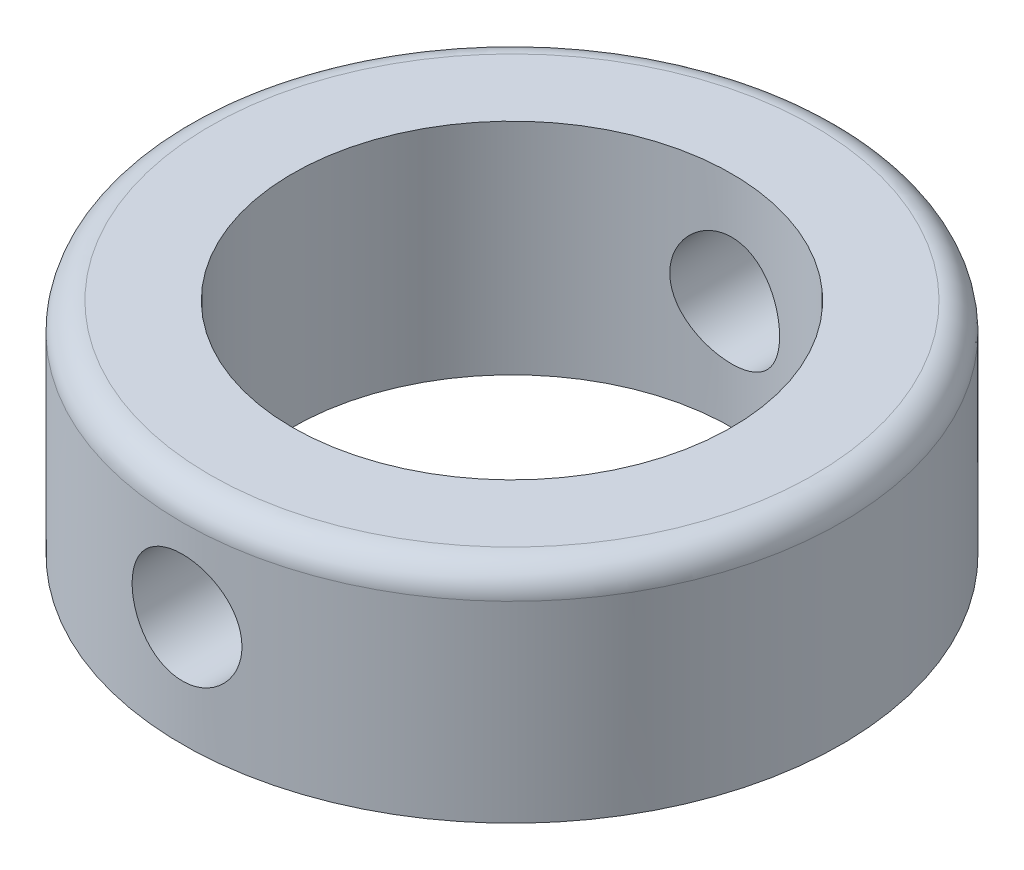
from build123d import *

# Parameters (mm, degrees)
SKETCH1_W                = 6
SKETCH1_H                = 4
F_8_0_8_DIAMETER_HOLE1_D = 8
F_2_0_2_DIAMETER_HOLE1_D = 2
FILLET1_R                = 0.501331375


with BuildPart() as part:
    # Sketch1 → Revolve1 (revolve)
    with BuildSketch(Plane.XY, mode=Mode.PRIVATE) as revolve1_sk:
        with Locations((2.999997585, 3.984171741)):
            Rectangle(SKETCH1_W, SKETCH1_H)
    revolve(revolve1_sk.sketch.rotate(Axis((-2.415e-06, 5.984196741, 0), (0, -1, 0)), 270), axis=Axis((-2.415e-06, 5.984196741, 0), (0, -1, 0)))

    # 8.0 _8_ Diameter Hole1 (through all)
    with Locations(Plane(origin=(0, 5.984171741, 0), x_dir=(1, 0, 0), z_dir=(0, 1, 0))):
        with Locations((-2.415e-06, -1.466e-06)):
            Hole(F_8_0_8_DIAMETER_HOLE1_D / 2)

    # 2.0 _2_ Diameter Hole1 (through all)
    with Locations(Plane.XY.offset(6.000012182)):
        with Locations((-2.415e-06, 3.984171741)):
            Hole(F_2_0_2_DIAMETER_HOLE1_D / 2)

    # Fillet1
    fillet1_edges = [part.edges().sort_by_distance(p)[0] for p in [
        (-2.415e-06, 5.984171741, 6),
    ]]
    fillet(fillet1_edges, radius=FILLET1_R)


solid = part.part
